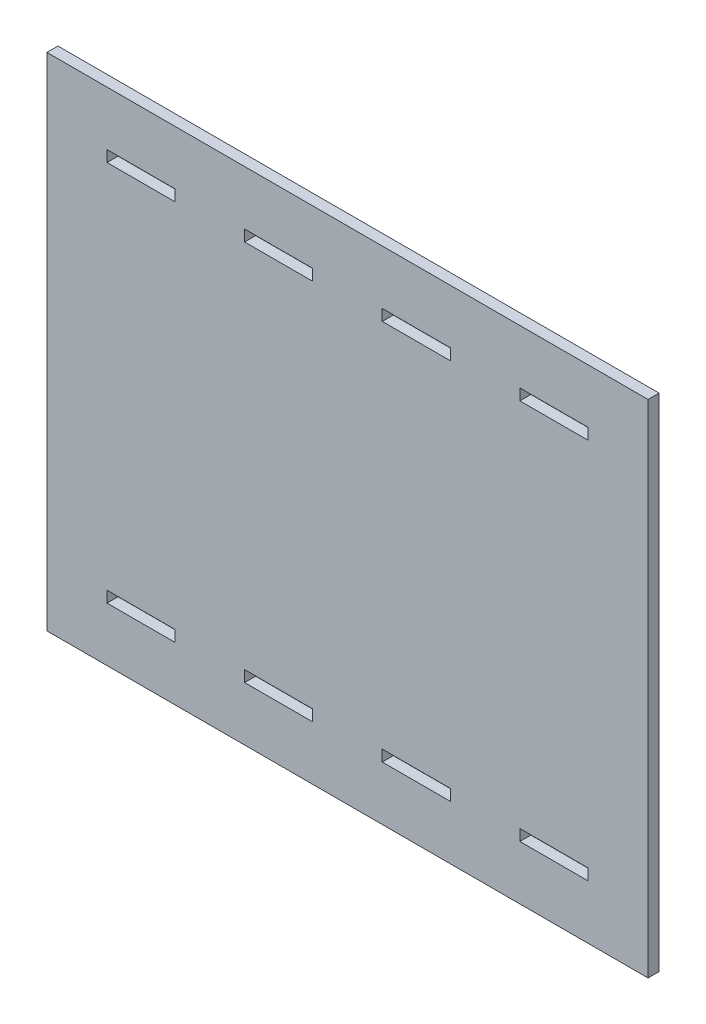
from build123d import *

# Parameters (mm, degrees)
CROQUIS1_W              = 300
CROQUIS1_H              = 250
SALIENTE_EXTRUIR1_DEPTH = 5.5
CROQUIS2_W              = 34
CROQUIS2_H              = 5.6
CORTAR_EXTRUIR1_DEPTH   = 5.5


with BuildPart() as part:
    # Croquis1 → Saliente-Extruir1 (new body)
    with BuildSketch(Plane.XY):
        Rectangle(CROQUIS1_W, CROQUIS1_H)
    extrude(amount=SALIENTE_EXTRUIR1_DEPTH)

    # Croquis2 → Cortar-Extruir1 (cut)
    with BuildSketch(Plane.XY.offset(5.5)):
        with Locations((-103, -95.2)):
            Rectangle(CROQUIS2_W, CROQUIS2_H)
        with Locations((-34.34, -95.2)):
            Rectangle(CROQUIS2_W, CROQUIS2_H)
        with Locations((34.34, -95.2)):
            Rectangle(CROQUIS2_W, CROQUIS2_H)
        with Locations((103, -95.2)):
            Rectangle(CROQUIS2_W, CROQUIS2_H)
        with Locations((-103, 95.2)):
            Rectangle(CROQUIS2_W, CROQUIS2_H)
        with Locations((-34.34, 95.2)):
            Rectangle(CROQUIS2_W, CROQUIS2_H)
        with Locations((34.34, 95.2)):
            Rectangle(CROQUIS2_W, CROQUIS2_H)
        with Locations((103, 95.2)):
            Rectangle(CROQUIS2_W, CROQUIS2_H)
    extrude(amount=-CORTAR_EXTRUIR1_DEPTH, mode=Mode.SUBTRACT)


solid = part.part
